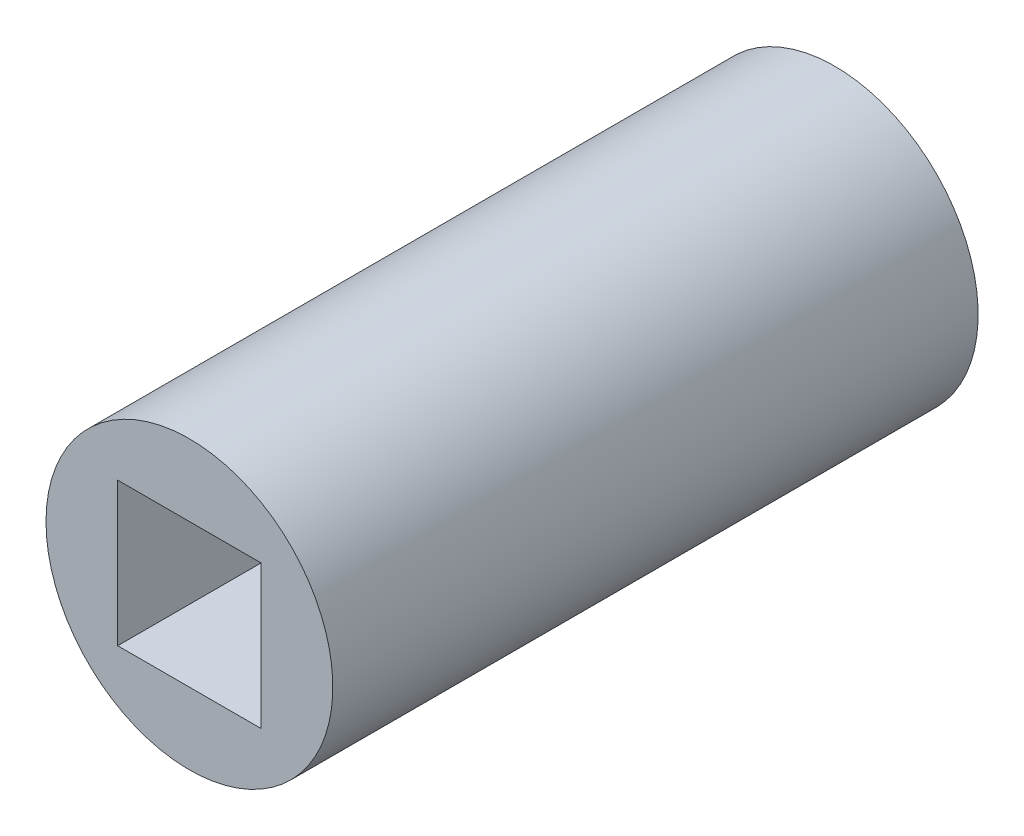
from build123d import *

# Parameters (mm, degrees)
SKETCH1_R           = 10
SKETCH1_W           = 10
SKETCH1_H           = 10
BOSS_EXTRUDE1_DEPTH = 45


with BuildPart() as part:
    # Sketch1 → Boss-Extrude1 (new body)
    with BuildSketch(Plane.XY):
        with Locations(Location((0, 0, 0), (0, 0, 180))):
            Circle(SKETCH1_R)
        Rectangle(SKETCH1_W, SKETCH1_H, mode=Mode.SUBTRACT)
    extrude(amount=BOSS_EXTRUDE1_DEPTH)


solid = part.part
